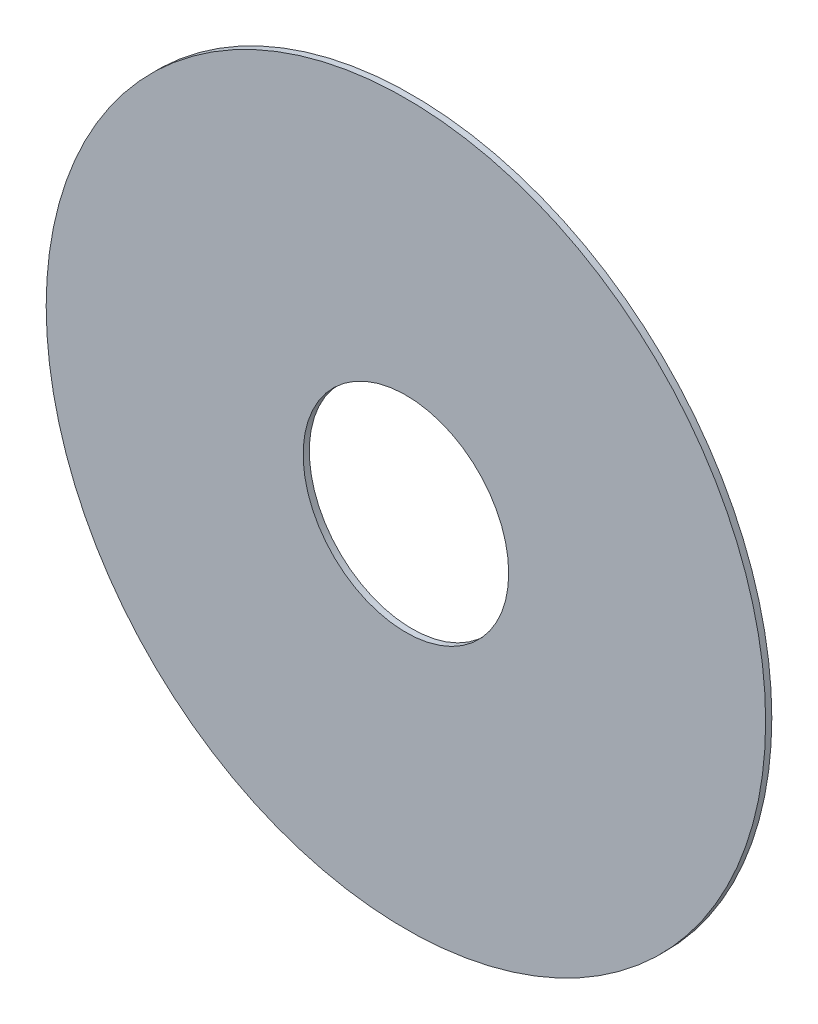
from build123d import *

# Parameters (mm, degrees)
SKETCH1_R           = 88.9
BOSS_EXTRUDE1_DEPTH = 1.524
SKETCH2_R           = 25.4
CUT_EXTRUDE1_DEPTH  = 1.524


with BuildPart() as part:
    # Sketch1 → Boss-Extrude1 (new body)
    with BuildSketch(Plane.XY):
        Circle(SKETCH1_R)
    extrude(amount=BOSS_EXTRUDE1_DEPTH)

    # Sketch2 → Cut-Extrude1 (cut)
    with BuildSketch(Plane.XY.offset(1.524)):
        Circle(SKETCH2_R)
    extrude(amount=-CUT_EXTRUDE1_DEPTH, mode=Mode.SUBTRACT)


solid = part.part
